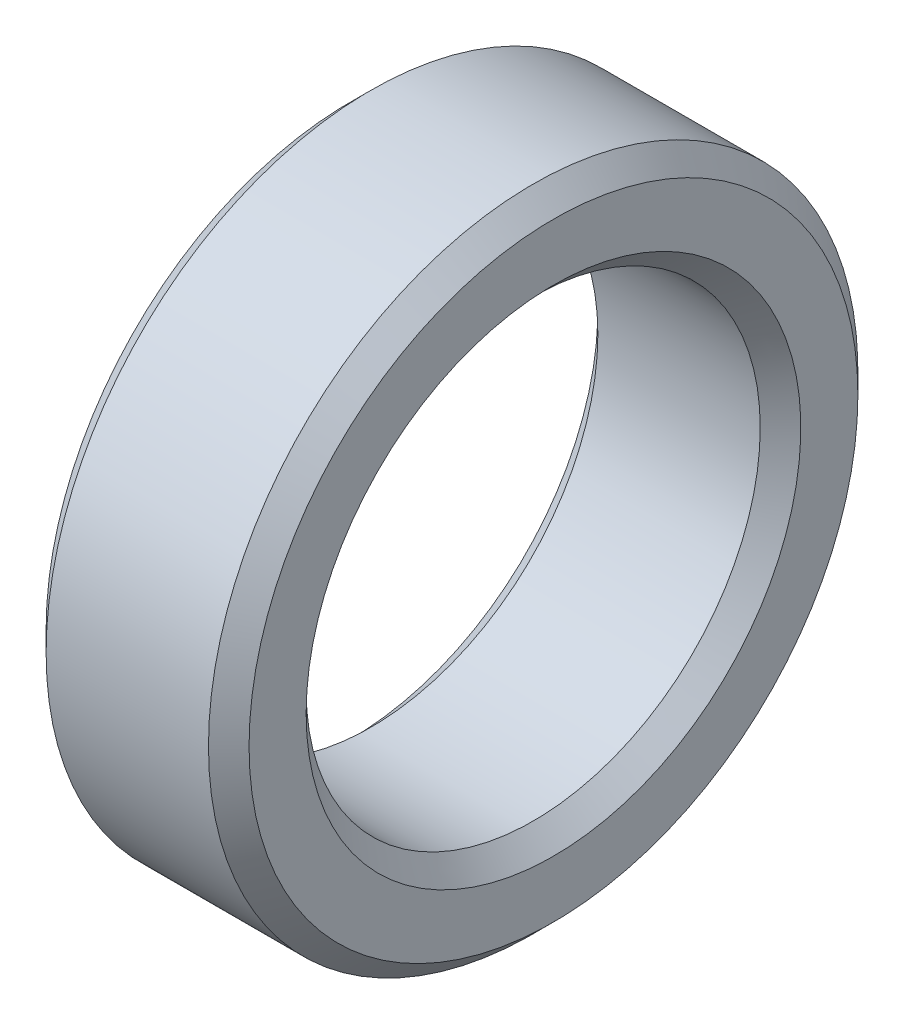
ISO-10303-21;
HEADER;
FILE_DESCRIPTION(('STEP AP214'),'2;1');
FILE_NAME('part.step','',(''),(''),'','','');
FILE_SCHEMA(('AUTOMOTIVE_DESIGN { 1 0 10303 214 1 1 1 1 }'));
ENDSEC;
DATA;
#1=APPLICATION_CONTEXT('core data for automotive mechanical design processes');
#2=APPLICATION_PROTOCOL_DEFINITION('international standard','automotive_design',2000,#1);
#3=PRODUCT_CONTEXT('',#1,'mechanical');
#4=PRODUCT('Part','Part','',(#3));
#5=PRODUCT_RELATED_PRODUCT_CATEGORY('part','',(#4));
#6=PRODUCT_DEFINITION_FORMATION('','',#4);
#7=PRODUCT_DEFINITION_CONTEXT('part definition',#1,'design');
#8=PRODUCT_DEFINITION('design','',#6,#7);
#9=PRODUCT_DEFINITION_SHAPE('','',#8);
#10=(LENGTH_UNIT() NAMED_UNIT(*) SI_UNIT(.MILLI.,.METRE.));
#11=(NAMED_UNIT(*) PLANE_ANGLE_UNIT() SI_UNIT($,.RADIAN.));
#12=(NAMED_UNIT(*) SI_UNIT($,.STERADIAN.) SOLID_ANGLE_UNIT());
#13=UNCERTAINTY_MEASURE_WITH_UNIT(LENGTH_MEASURE(1.E-05),#10,'distance_accuracy_value','');
#14=(GEOMETRIC_REPRESENTATION_CONTEXT(3) GLOBAL_UNCERTAINTY_ASSIGNED_CONTEXT((#13)) GLOBAL_UNIT_ASSIGNED_CONTEXT((#10,
#11,#12)) REPRESENTATION_CONTEXT('',''));
#15=CARTESIAN_POINT('',(0.,0.,0.));
#16=DIRECTION('',(0.,0.,1.));
#17=DIRECTION('',(1.,0.,0.));
#18=AXIS2_PLACEMENT_3D('',#15,#16,#17);
#19=CARTESIAN_POINT('',(0.,0.,0.));
#20=DIRECTION('',(-1.,0.,0.));
#21=DIRECTION('',(0.,0.,1.));
#22=AXIS2_PLACEMENT_3D('',#19,#20,#21);
#23=CONICAL_SURFACE('',#22,12.188,0.785398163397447);
#24=CARTESIAN_POINT('',(1.,0.,0.));
#25=DIRECTION('',(-1.,0.,0.));
#26=DIRECTION('',(0.,0.,1.));
#27=AXIS2_PLACEMENT_3D('',#24,#25,#26);
#28=CIRCLE('',#27,11.188);
#29=CARTESIAN_POINT('',(1.,0.,11.188));
#30=VERTEX_POINT('',#29);
#31=EDGE_CURVE('E10',#30,#30,#28,.T.);
#32=ORIENTED_EDGE('',*,*,#31,.F.);
#33=EDGE_LOOP('',(#32));
#34=FACE_BOUND('',#33,.T.);
#35=CARTESIAN_POINT('',(0.,0.,0.));
#36=DIRECTION('',(-1.,0.,0.));
#37=DIRECTION('',(0.,0.,1.));
#38=AXIS2_PLACEMENT_3D('',#35,#36,#37);
#39=CIRCLE('',#38,12.188);
#40=CARTESIAN_POINT('',(0.,0.,12.188));
#41=VERTEX_POINT('',#40);
#42=EDGE_CURVE('E52',#41,#41,#39,.T.);
#43=ORIENTED_EDGE('',*,*,#42,.T.);
#44=EDGE_LOOP('',(#43));
#45=FACE_BOUND('',#44,.T.);
#46=ADVANCED_FACE('F24',(#34,#45),#23,.F.);
#47=CARTESIAN_POINT('',(0.,0.,0.));
#48=DIRECTION('',(-1.,0.,0.));
#49=DIRECTION('',(0.,0.,1.));
#50=AXIS2_PLACEMENT_3D('',#47,#48,#49);
#51=CYLINDRICAL_SURFACE('',#50,11.188);
#52=CARTESIAN_POINT('',(9.00000000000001,0.,0.));
#53=DIRECTION('',(-1.,0.,0.));
#54=DIRECTION('',(0.,0.,1.));
#55=AXIS2_PLACEMENT_3D('',#52,#53,#54);
#56=CIRCLE('',#55,11.188);
#57=CARTESIAN_POINT('',(9.00000000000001,0.,11.188));
#58=VERTEX_POINT('',#57);
#59=EDGE_CURVE('E30',#58,#58,#56,.T.);
#60=ORIENTED_EDGE('',*,*,#59,.F.);
#61=EDGE_LOOP('',(#60));
#62=FACE_BOUND('',#61,.T.);
#63=ORIENTED_EDGE('',*,*,#31,.T.);
#64=EDGE_LOOP('',(#63));
#65=FACE_BOUND('',#64,.T.);
#66=ADVANCED_FACE('F89',(#62,#65),#51,.F.);
#67=CARTESIAN_POINT('',(9.00000000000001,0.,0.));
#68=DIRECTION('',(1.,0.,0.));
#69=DIRECTION('',(0.,0.,-1.));
#70=AXIS2_PLACEMENT_3D('',#67,#68,#69);
#71=CONICAL_SURFACE('',#70,11.188,0.78539816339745);
#72=CARTESIAN_POINT('',(9.99999999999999,0.,0.));
#73=DIRECTION('',(-1.,0.,0.));
#74=DIRECTION('',(0.,0.,1.));
#75=AXIS2_PLACEMENT_3D('',#72,#73,#74);
#76=CIRCLE('',#75,12.188);
#77=CARTESIAN_POINT('',(9.99999999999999,0.,12.188));
#78=VERTEX_POINT('',#77);
#79=EDGE_CURVE('E34',#78,#78,#76,.T.);
#80=ORIENTED_EDGE('',*,*,#79,.F.);
#81=EDGE_LOOP('',(#80));
#82=FACE_BOUND('',#81,.T.);
#83=ORIENTED_EDGE('',*,*,#59,.T.);
#84=EDGE_LOOP('',(#83));
#85=FACE_BOUND('',#84,.T.);
#86=ADVANCED_FACE('F84',(#82,#85),#71,.F.);
#87=CARTESIAN_POINT('',(10.,15.,0.));
#88=DIRECTION('',(-1.,0.,0.));
#89=DIRECTION('',(0.,0.,1.));
#90=AXIS2_PLACEMENT_3D('',#87,#88,#89);
#91=PLANE('',#90);
#92=CARTESIAN_POINT('',(10.,0.,0.));
#93=DIRECTION('',(-1.,0.,0.));
#94=DIRECTION('',(0.,0.,1.));
#95=AXIS2_PLACEMENT_3D('',#92,#93,#94);
#96=CIRCLE('',#95,15.);
#97=CARTESIAN_POINT('',(10.,0.,15.));
#98=VERTEX_POINT('',#97);
#99=EDGE_CURVE('E38',#98,#98,#96,.T.);
#100=ORIENTED_EDGE('',*,*,#99,.F.);
#101=EDGE_LOOP('',(#100));
#102=FACE_BOUND('',#101,.T.);
#103=ORIENTED_EDGE('',*,*,#79,.T.);
#104=EDGE_LOOP('',(#103));
#105=FACE_BOUND('',#104,.T.);
#106=ADVANCED_FACE('F78',(#102,#105),#91,.F.);
#107=CARTESIAN_POINT('',(10.,0.,0.));
#108=DIRECTION('',(-1.,0.,0.));
#109=DIRECTION('',(0.,0.,1.));
#110=AXIS2_PLACEMENT_3D('',#107,#108,#109);
#111=CONICAL_SURFACE('',#110,15.,0.785398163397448);
#112=CARTESIAN_POINT('',(9.00000000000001,0.,0.));
#113=DIRECTION('',(-1.,0.,0.));
#114=DIRECTION('',(0.,0.,1.));
#115=AXIS2_PLACEMENT_3D('',#112,#113,#114);
#116=CIRCLE('',#115,16.);
#117=CARTESIAN_POINT('',(9.00000000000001,0.,16.));
#118=VERTEX_POINT('',#117);
#119=EDGE_CURVE('E43',#118,#118,#116,.T.);
#120=ORIENTED_EDGE('',*,*,#119,.F.);
#121=EDGE_LOOP('',(#120));
#122=FACE_BOUND('',#121,.T.);
#123=ORIENTED_EDGE('',*,*,#99,.T.);
#124=EDGE_LOOP('',(#123));
#125=FACE_BOUND('',#124,.T.);
#126=ADVANCED_FACE('F72',(#122,#125),#111,.T.);
#127=CARTESIAN_POINT('',(0.,0.,0.));
#128=DIRECTION('',(-1.,0.,0.));
#129=DIRECTION('',(0.,0.,1.));
#130=AXIS2_PLACEMENT_3D('',#127,#128,#129);
#131=CYLINDRICAL_SURFACE('',#130,16.);
#132=CARTESIAN_POINT('',(1.,0.,0.));
#133=DIRECTION('',(-1.,0.,0.));
#134=DIRECTION('',(0.,0.,1.));
#135=AXIS2_PLACEMENT_3D('',#132,#133,#134);
#136=CIRCLE('',#135,16.);
#137=CARTESIAN_POINT('',(1.,0.,16.));
#138=VERTEX_POINT('',#137);
#139=EDGE_CURVE('E46',#138,#138,#136,.T.);
#140=ORIENTED_EDGE('',*,*,#139,.F.);
#141=EDGE_LOOP('',(#140));
#142=FACE_BOUND('',#141,.T.);
#143=ORIENTED_EDGE('',*,*,#119,.T.);
#144=EDGE_LOOP('',(#143));
#145=FACE_BOUND('',#144,.T.);
#146=ADVANCED_FACE('F66',(#142,#145),#131,.T.);
#147=CARTESIAN_POINT('',(1.,0.,0.));
#148=DIRECTION('',(1.,0.,0.));
#149=DIRECTION('',(0.,0.,-1.));
#150=AXIS2_PLACEMENT_3D('',#147,#148,#149);
#151=CONICAL_SURFACE('',#150,16.,0.785398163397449);
#152=CARTESIAN_POINT('',(0.,0.,0.));
#153=DIRECTION('',(-1.,0.,0.));
#154=DIRECTION('',(0.,0.,1.));
#155=AXIS2_PLACEMENT_3D('',#152,#153,#154);
#156=CIRCLE('',#155,15.);
#157=CARTESIAN_POINT('',(0.,0.,15.));
#158=VERTEX_POINT('',#157);
#159=EDGE_CURVE('E49',#158,#158,#156,.T.);
#160=ORIENTED_EDGE('',*,*,#159,.F.);
#161=EDGE_LOOP('',(#160));
#162=FACE_BOUND('',#161,.T.);
#163=ORIENTED_EDGE('',*,*,#139,.T.);
#164=EDGE_LOOP('',(#163));
#165=FACE_BOUND('',#164,.T.);
#166=ADVANCED_FACE('F60',(#162,#165),#151,.T.);
#167=CARTESIAN_POINT('',(0.,12.188,0.));
#168=DIRECTION('',(1.,0.,0.));
#169=DIRECTION('',(0.,0.,-1.));
#170=AXIS2_PLACEMENT_3D('',#167,#168,#169);
#171=PLANE('',#170);
#172=ORIENTED_EDGE('',*,*,#42,.F.);
#173=EDGE_LOOP('',(#172));
#174=FACE_BOUND('',#173,.T.);
#175=ORIENTED_EDGE('',*,*,#159,.T.);
#176=EDGE_LOOP('',(#175));
#177=FACE_BOUND('',#176,.T.);
#178=ADVANCED_FACE('F57',(#174,#177),#171,.F.);
#179=CLOSED_SHELL('',(#46,#66,#86,#106,#126,#146,#166,#178));
#180=MANIFOLD_SOLID_BREP('B2',#179);
#181=ADVANCED_BREP_SHAPE_REPRESENTATION('',(#18,#180),#14);
#182=SHAPE_DEFINITION_REPRESENTATION(#9,#181);
ENDSEC;
END-ISO-10303-21;
